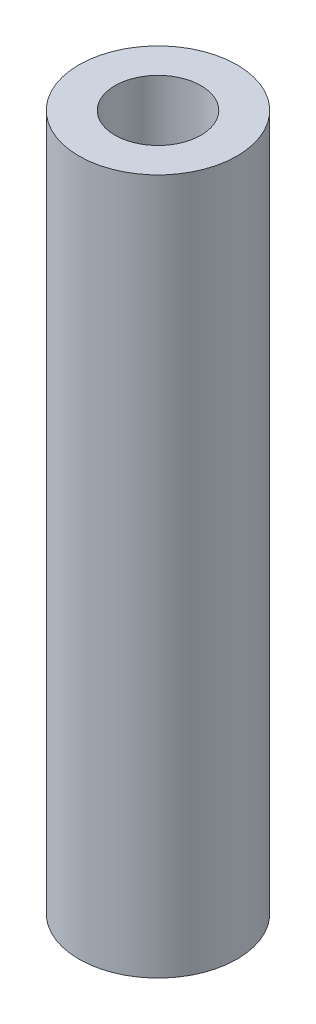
from build123d import *

# Parameters (mm, degrees)
SKETCH1_R                 = 3.175
EXTRUDE1_DEPTH            = 27.94
F_8_32_TAPPED_HOLE1_D     = 3.4544
F_8_32_TAPPED_HOLE1_DEPTH = 12.2936
F_8_32_TAPPED_HOLE1_TIP   = 1.037806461
F_8_32_TAPPED_HOLE2_D     = 3.4544
F_8_32_TAPPED_HOLE2_DEPTH = 12.2936
F_8_32_TAPPED_HOLE2_TIP   = 1.037806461


with BuildPart() as part:
    # Sketch1 → Extrude1 (new body)
    with BuildSketch(Plane(origin=(0, 0, 0), x_dir=(1, 0, 0), z_dir=(0, 1, 0))):
        with Locations(Location((0, 0, 0), (0, 0, 270))):
            Circle(SKETCH1_R)
    extrude(amount=-EXTRUDE1_DEPTH)

    # 8-32 Tapped Hole1
    with Locations(Plane.ZX):
        with Locations((0, 0)):
            Hole(F_8_32_TAPPED_HOLE1_D / 2, depth=F_8_32_TAPPED_HOLE1_DEPTH)
            with Locations((0, 0, -(F_8_32_TAPPED_HOLE1_DEPTH + F_8_32_TAPPED_HOLE1_TIP / 2))):  # 118° drill point
                Cone(0, F_8_32_TAPPED_HOLE1_D / 2, F_8_32_TAPPED_HOLE1_TIP, mode=Mode.SUBTRACT)

    # 8-32 Tapped Hole2
    with Locations(Plane(origin=(0, -27.94, 0), x_dir=(0, 0, -1), z_dir=(0, -1, 0))):
        with Locations((0, 0)):
            Hole(F_8_32_TAPPED_HOLE2_D / 2, depth=F_8_32_TAPPED_HOLE2_DEPTH)
            with Locations((0, 0, -(F_8_32_TAPPED_HOLE2_DEPTH + F_8_32_TAPPED_HOLE2_TIP / 2))):  # 118° drill point
                Cone(0, F_8_32_TAPPED_HOLE2_D / 2, F_8_32_TAPPED_HOLE2_TIP, mode=Mode.SUBTRACT)


solid = part.part
